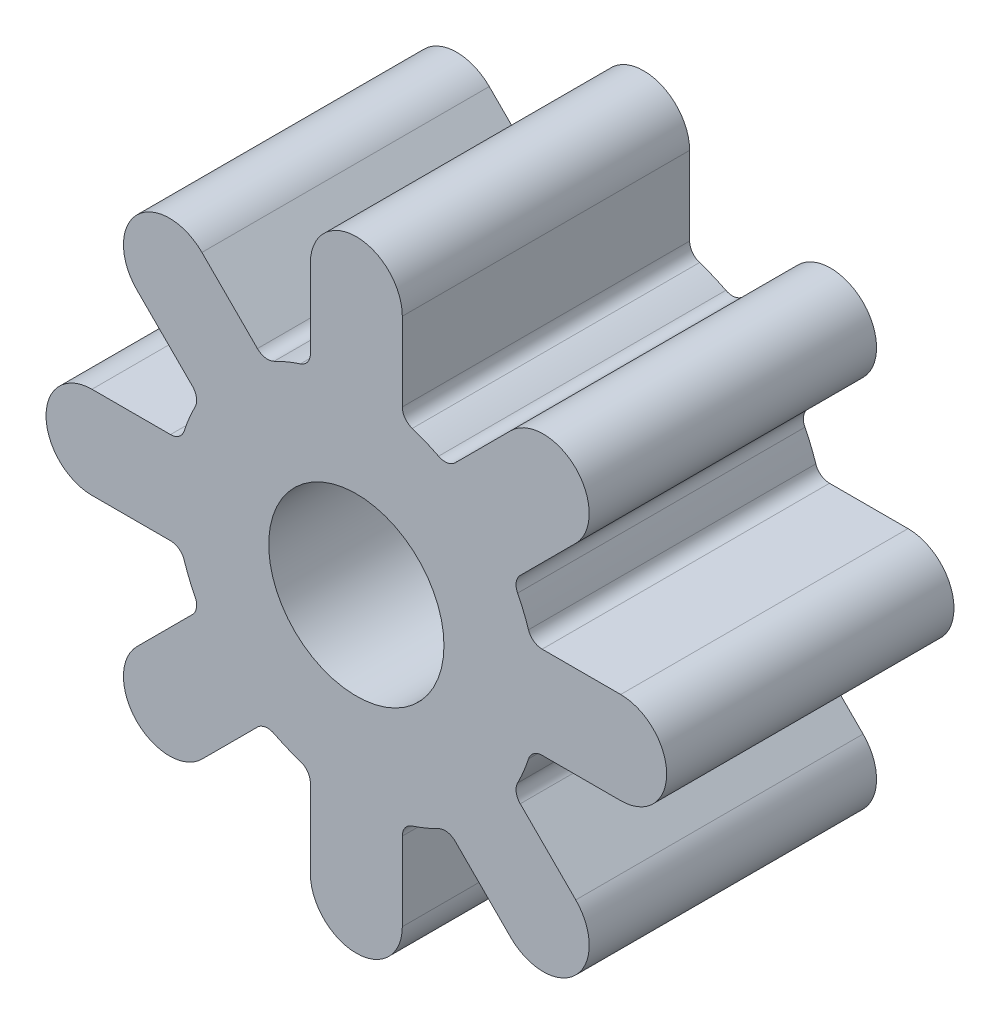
from build123d import *

# Parameters (mm, degrees)
BOSS_EXTRUDE1_DEPTH = 10
SKETCH2_R           = 3.05
CUT_EXTRUDE1_DEPTH  = 10


with BuildPart() as part:
    # Sketch1 → Boss-Extrude1 (new body)
    with BuildSketch(Plane.XY):
        with BuildLine():
            Line((-1.6, 9.2), (-1.6, 6.467611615))
            ThreePointArc((-1.6, 6.467611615), (-1.695521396, 6.173677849), (-1.945588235, 5.992051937))
            ThreePointArc((-1.945588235, 5.992051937), (-2.410905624, 5.820441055), (-2.861281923, 5.612759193))
            ThreePointArc((-2.861281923, 5.612759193), (-3.166534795, 5.564364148), (-3.441921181, 5.704662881))
            Line((-3.441921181, 5.704662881), (-5.374011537, 7.636753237))
            ThreePointArc((-5.374011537, 7.636753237), (-7.636753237, 7.636753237), (-7.636753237, 5.374011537))
            Line((-7.636753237, 5.374011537), (-5.704662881, 3.441921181))
            ThreePointArc((-5.704662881, 3.441921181), (-5.564364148, 3.166534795), (-5.612759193, 2.861281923))
            ThreePointArc((-5.612759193, 2.861281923), (-5.820441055, 2.410905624), (-5.992051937, 1.945588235))
            ThreePointArc((-5.992051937, 1.945588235), (-6.173677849, 1.695521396), (-6.467611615, 1.6))
            Line((-6.467611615, 1.6), (-9.2, 1.6))
            ThreePointArc((-9.2, 1.6), (-10.8, 0), (-9.2, -1.6))
            Line((-9.2, -1.6), (-6.467611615, -1.6))
            ThreePointArc((-6.467611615, -1.6), (-6.173677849, -1.695521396), (-5.992051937, -1.945588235))
            ThreePointArc((-5.992051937, -1.945588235), (-5.820441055, -2.410905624), (-5.612759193, -2.861281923))
            ThreePointArc((-5.612759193, -2.861281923), (-5.564364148, -3.166534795), (-5.704662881, -3.441921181))
            Line((-5.704662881, -3.441921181), (-7.636753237, -5.374011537))
            ThreePointArc((-7.636753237, -5.374011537), (-7.636753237, -7.636753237), (-5.374011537, -7.636753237))
            Line((-5.374011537, -7.636753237), (-3.441921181, -5.704662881))
            ThreePointArc((-3.441921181, -5.704662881), (-3.166534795, -5.564364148), (-2.861281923, -5.612759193))
            ThreePointArc((-2.861281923, -5.612759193), (-2.410905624, -5.820441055), (-1.945588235, -5.992051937))
            ThreePointArc((-1.945588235, -5.992051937), (-1.695521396, -6.173677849), (-1.6, -6.467611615))
            Line((-1.6, -6.467611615), (-1.6, -9.2))
            ThreePointArc((-1.6, -9.2), (0, -10.8), (1.6, -9.2))
            Line((1.6, -9.2), (1.6, -6.467611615))
            ThreePointArc((1.6, -6.467611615), (1.695521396, -6.173677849), (1.945588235, -5.992051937))
            ThreePointArc((1.945588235, -5.992051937), (2.410905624, -5.820441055), (2.861281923, -5.612759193))
            ThreePointArc((2.861281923, -5.612759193), (3.166534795, -5.564364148), (3.441921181, -5.704662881))
            Line((3.441921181, -5.704662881), (5.374011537, -7.636753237))
            ThreePointArc((5.374011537, -7.636753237), (7.636753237, -7.636753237), (7.636753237, -5.374011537))
            Line((7.636753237, -5.374011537), (5.704662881, -3.441921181))
            ThreePointArc((5.704662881, -3.441921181), (5.564364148, -3.166534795), (5.612759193, -2.861281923))
            ThreePointArc((5.612759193, -2.861281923), (5.820441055, -2.410905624), (5.992051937, -1.945588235))
            ThreePointArc((5.992051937, -1.945588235), (6.173677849, -1.695521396), (6.467611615, -1.6))
            Line((6.467611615, -1.6), (9.2, -1.6))
            ThreePointArc((9.2, -1.6), (10.8, 0), (9.2, 1.6))
            Line((9.2, 1.6), (6.467611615, 1.6))
            ThreePointArc((6.467611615, 1.6), (6.173677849, 1.695521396), (5.992051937, 1.945588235))
            ThreePointArc((5.992051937, 1.945588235), (5.820441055, 2.410905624), (5.612759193, 2.861281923))
            ThreePointArc((5.612759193, 2.861281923), (5.564364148, 3.166534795), (5.704662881, 3.441921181))
            Line((5.704662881, 3.441921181), (7.636753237, 5.374011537))
            ThreePointArc((7.636753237, 5.374011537), (7.636753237, 7.636753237), (5.374011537, 7.636753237))
            Line((5.374011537, 7.636753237), (3.441921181, 5.704662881))
            ThreePointArc((3.441921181, 5.704662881), (3.166534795, 5.564364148), (2.861281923, 5.612759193))
            ThreePointArc((2.861281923, 5.612759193), (2.410905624, 5.820441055), (1.945588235, 5.992051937))
            ThreePointArc((1.945588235, 5.992051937), (1.695521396, 6.173677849), (1.6, 6.467611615))
            Line((1.6, 6.467611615), (1.6, 9.2))
            ThreePointArc((1.6, 9.2), (0, 10.8), (-1.6, 9.2))
        make_face()
    extrude(amount=BOSS_EXTRUDE1_DEPTH)

    # Sketch2 → Cut-Extrude1 (cut)
    with BuildSketch(Plane.XY.offset(10)):
        Circle(SKETCH2_R)
    extrude(amount=-CUT_EXTRUDE1_DEPTH, mode=Mode.SUBTRACT)


solid = part.part
